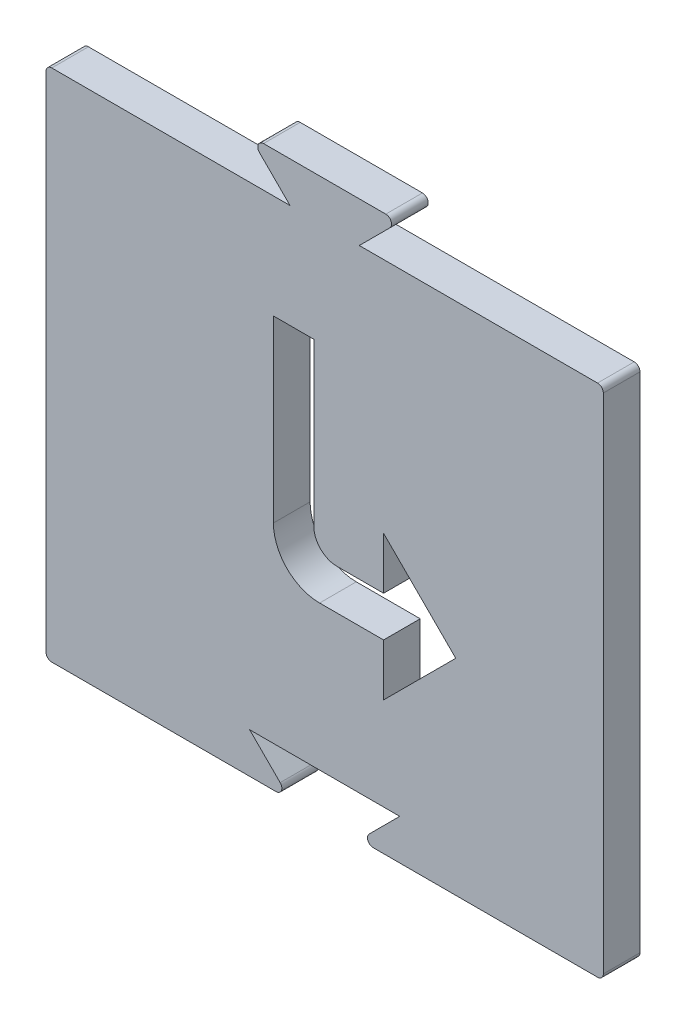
from build123d import *

# Parameters (mm, degrees)
BOSS_EXTRUDE1_DEPTH = 3.175
CUT_EXTRUDE2_DEPTH  = 69.182635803
FILLET1_R           = 2
FILLET2_R           = 4
FILLET3_R           = 0.5


with BuildPart() as part:
    # Sketch1 → Boss-Extrude1 (new body)
    with BuildSketch(Plane.XY):
        Polygon((48.26, 35.56), (48.26, 0), (27.13, 0), (30.63, 3.5), (17.63, 3.5), (21.13, 0), (0, 0), (0, 35.56), (0, 44.56), (21.13, 44.56), (17.63, 48.06), (30.63, 48.06), (27.13, 44.56), (48.26, 44.56), align=None)
    extrude(amount=BOSS_EXTRUDE1_DEPTH)

    # Sketch4 → Cut-Extrude2 (cut, through all)
    with BuildSketch(Plane.XY.offset(3.175)):
        Polygon((23.192581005, 35.56), (23.192581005, 19.53), (29.231483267, 19.53), (29.231483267, 24.03), (35.481483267, 17.78), (29.231483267, 11.53), (29.231483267, 16.03), (19.692581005, 16.03), (19.692581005, 35.56), align=None)
    extrude(amount=-CUT_EXTRUDE2_DEPTH, mode=Mode.SUBTRACT)

    # Fillet1
    fillet1_edges = [part.edges().sort_by_distance(p)[0] for p in [
        (23.192581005, 19.53, 1.5875),
    ]]
    fillet(fillet1_edges, radius=FILLET1_R)

    # Fillet2
    fillet2_edges = [part.edges().sort_by_distance(p)[0] for p in [
        (19.692581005, 16.03, 1.5875),
    ]]
    fillet(fillet2_edges, radius=FILLET2_R)

    # Fillet3
    fillet3_edges = [part.edges().sort_by_distance(p)[0] for p in [
        (0, 44.56, 1.5875),
        (17.63, 48.06, 1.5875),
        (30.63, 48.06, 1.5875),
        (48.26, 44.56, 1.5875),
        (48.26, 0, 1.5875),
        (27.13, 0, 1.5875),
        (21.13, 0, 1.5875),
        (0, 0, 1.5875),
    ]]
    fillet(fillet3_edges, radius=FILLET3_R)


solid = part.part
